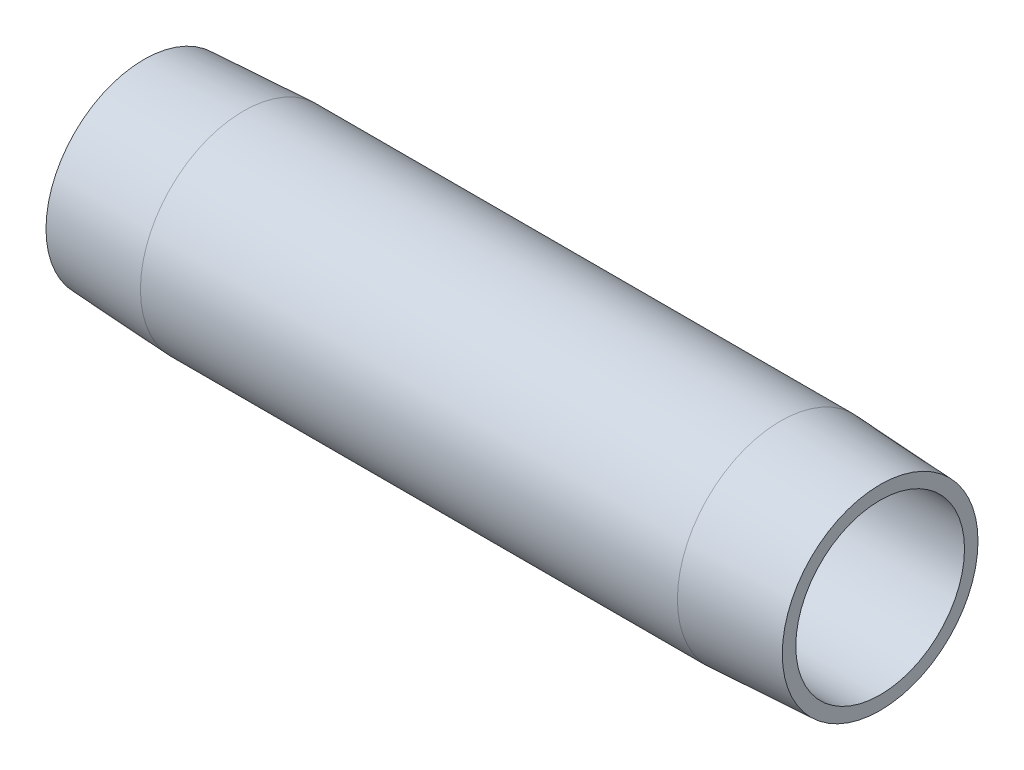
ISO-10303-21;
HEADER;
FILE_DESCRIPTION(('STEP AP214'),'2;1');
FILE_NAME('part.step','',(''),(''),'','','');
FILE_SCHEMA(('AUTOMOTIVE_DESIGN { 1 0 10303 214 1 1 1 1 }'));
ENDSEC;
DATA;
#1=APPLICATION_CONTEXT('core data for automotive mechanical design processes');
#2=APPLICATION_PROTOCOL_DEFINITION('international standard','automotive_design',2000,#1);
#3=PRODUCT_CONTEXT('',#1,'mechanical');
#4=PRODUCT('Part','Part','',(#3));
#5=PRODUCT_RELATED_PRODUCT_CATEGORY('part','',(#4));
#6=PRODUCT_DEFINITION_FORMATION('','',#4);
#7=PRODUCT_DEFINITION_CONTEXT('part definition',#1,'design');
#8=PRODUCT_DEFINITION('design','',#6,#7);
#9=PRODUCT_DEFINITION_SHAPE('','',#8);
#10=(LENGTH_UNIT() NAMED_UNIT(*) SI_UNIT(.MILLI.,.METRE.));
#11=(NAMED_UNIT(*) PLANE_ANGLE_UNIT() SI_UNIT($,.RADIAN.));
#12=(NAMED_UNIT(*) SI_UNIT($,.STERADIAN.) SOLID_ANGLE_UNIT());
#13=UNCERTAINTY_MEASURE_WITH_UNIT(LENGTH_MEASURE(1.E-05),#10,'distance_accuracy_value','');
#14=(GEOMETRIC_REPRESENTATION_CONTEXT(3) GLOBAL_UNCERTAINTY_ASSIGNED_CONTEXT((#13)) GLOBAL_UNIT_ASSIGNED_CONTEXT((#10,
#11,#12)) REPRESENTATION_CONTEXT('',''));
#15=CARTESIAN_POINT('',(0.,0.,0.));
#16=DIRECTION('',(0.,0.,1.));
#17=DIRECTION('',(1.,0.,0.));
#18=AXIS2_PLACEMENT_3D('',#15,#16,#17);
#19=CARTESIAN_POINT('',(76.2,8.73125,0.));
#20=DIRECTION('',(-1.,0.,0.));
#21=DIRECTION('',(0.,0.,1.));
#22=AXIS2_PLACEMENT_3D('',#19,#20,#21);
#23=PLANE('',#22);
#24=CARTESIAN_POINT('',(76.2,0.,0.));
#25=DIRECTION('',(-1.,0.,0.));
#26=DIRECTION('',(0.,0.,1.));
#27=AXIS2_PLACEMENT_3D('',#24,#25,#26);
#28=CIRCLE('',#27,10.1275500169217);
#29=CARTESIAN_POINT('',(76.2,0.,10.1275500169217));
#30=VERTEX_POINT('',#29);
#31=EDGE_CURVE('E10',#30,#30,#28,.T.);
#32=ORIENTED_EDGE('',*,*,#31,.F.);
#33=EDGE_LOOP('',(#32));
#34=FACE_BOUND('',#33,.T.);
#35=CARTESIAN_POINT('',(76.2,0.,0.));
#36=DIRECTION('',(-1.,0.,0.));
#37=DIRECTION('',(0.,0.,1.));
#38=AXIS2_PLACEMENT_3D('',#35,#36,#37);
#39=CIRCLE('',#38,8.73125);
#40=CARTESIAN_POINT('',(76.2,0.,8.73125));
#41=VERTEX_POINT('',#40);
#42=EDGE_CURVE('E52',#41,#41,#39,.T.);
#43=ORIENTED_EDGE('',*,*,#42,.T.);
#44=EDGE_LOOP('',(#43));
#45=FACE_BOUND('',#44,.T.);
#46=ADVANCED_FACE('F30',(#34,#45),#23,.F.);
#47=CARTESIAN_POINT('',(76.2,0.,0.));
#48=DIRECTION('',(-1.,0.,0.));
#49=DIRECTION('',(0.,0.,1.));
#50=AXIS2_PLACEMENT_3D('',#47,#48,#49);
#51=CONICAL_SURFACE('',#50,10.1275500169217,0.052359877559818);
#52=CARTESIAN_POINT('',(65.8876,0.,0.));
#53=DIRECTION('',(-1.,0.,0.));
#54=DIRECTION('',(0.,0.,1.));
#55=AXIS2_PLACEMENT_3D('',#52,#53,#54);
#56=CIRCLE('',#55,10.668);
#57=CARTESIAN_POINT('',(65.8876,0.,10.668));
#58=VERTEX_POINT('',#57);
#59=EDGE_CURVE('E36',#58,#58,#56,.T.);
#60=ORIENTED_EDGE('',*,*,#59,.F.);
#61=EDGE_LOOP('',(#60));
#62=FACE_BOUND('',#61,.T.);
#63=ORIENTED_EDGE('',*,*,#31,.T.);
#64=EDGE_LOOP('',(#63));
#65=FACE_BOUND('',#64,.T.);
#66=ADVANCED_FACE('F77',(#62,#65),#51,.T.);
#67=CARTESIAN_POINT('',(0.,0.,0.));
#68=DIRECTION('',(-1.,0.,0.));
#69=DIRECTION('',(0.,0.,1.));
#70=AXIS2_PLACEMENT_3D('',#67,#68,#69);
#71=CYLINDRICAL_SURFACE('',#70,10.668);
#72=CARTESIAN_POINT('',(10.3124,0.,0.));
#73=DIRECTION('',(-1.,0.,0.));
#74=DIRECTION('',(0.,0.,1.));
#75=AXIS2_PLACEMENT_3D('',#72,#73,#74);
#76=CIRCLE('',#75,10.668);
#77=CARTESIAN_POINT('',(10.3124,0.,10.668));
#78=VERTEX_POINT('',#77);
#79=EDGE_CURVE('E40',#78,#78,#76,.T.);
#80=ORIENTED_EDGE('',*,*,#79,.F.);
#81=EDGE_LOOP('',(#80));
#82=FACE_BOUND('',#81,.T.);
#83=ORIENTED_EDGE('',*,*,#59,.T.);
#84=EDGE_LOOP('',(#83));
#85=FACE_BOUND('',#84,.T.);
#86=ADVANCED_FACE('F72',(#82,#85),#71,.T.);
#87=CARTESIAN_POINT('',(10.3124,0.,0.));
#88=DIRECTION('',(1.,0.,0.));
#89=DIRECTION('',(0.,0.,-1.));
#90=AXIS2_PLACEMENT_3D('',#87,#88,#89);
#91=CONICAL_SURFACE('',#90,10.668,0.0523598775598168);
#92=CARTESIAN_POINT('',(0.,0.,0.));
#93=DIRECTION('',(-1.,0.,0.));
#94=DIRECTION('',(0.,0.,1.));
#95=AXIS2_PLACEMENT_3D('',#92,#93,#94);
#96=CIRCLE('',#95,10.1275500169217);
#97=CARTESIAN_POINT('',(0.,0.,10.1275500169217));
#98=VERTEX_POINT('',#97);
#99=EDGE_CURVE('E44',#98,#98,#96,.T.);
#100=ORIENTED_EDGE('',*,*,#99,.F.);
#101=EDGE_LOOP('',(#100));
#102=FACE_BOUND('',#101,.T.);
#103=ORIENTED_EDGE('',*,*,#79,.T.);
#104=EDGE_LOOP('',(#103));
#105=FACE_BOUND('',#104,.T.);
#106=ADVANCED_FACE('F66',(#102,#105),#91,.T.);
#107=CARTESIAN_POINT('',(0.,10.1275500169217,0.));
#108=DIRECTION('',(1.,0.,0.));
#109=DIRECTION('',(0.,0.,-1.));
#110=AXIS2_PLACEMENT_3D('',#107,#108,#109);
#111=PLANE('',#110);
#112=CARTESIAN_POINT('',(0.,0.,0.));
#113=DIRECTION('',(-1.,0.,0.));
#114=DIRECTION('',(0.,0.,1.));
#115=AXIS2_PLACEMENT_3D('',#112,#113,#114);
#116=CIRCLE('',#115,8.73125);
#117=CARTESIAN_POINT('',(0.,0.,8.73125));
#118=VERTEX_POINT('',#117);
#119=EDGE_CURVE('E49',#118,#118,#116,.T.);
#120=ORIENTED_EDGE('',*,*,#119,.F.);
#121=EDGE_LOOP('',(#120));
#122=FACE_BOUND('',#121,.T.);
#123=ORIENTED_EDGE('',*,*,#99,.T.);
#124=EDGE_LOOP('',(#123));
#125=FACE_BOUND('',#124,.T.);
#126=ADVANCED_FACE('F60',(#122,#125),#111,.F.);
#127=CARTESIAN_POINT('',(0.,0.,0.));
#128=DIRECTION('',(-1.,0.,0.));
#129=DIRECTION('',(0.,0.,1.));
#130=AXIS2_PLACEMENT_3D('',#127,#128,#129);
#131=CYLINDRICAL_SURFACE('',#130,8.73125);
#132=ORIENTED_EDGE('',*,*,#42,.F.);
#133=EDGE_LOOP('',(#132));
#134=FACE_BOUND('',#133,.T.);
#135=ORIENTED_EDGE('',*,*,#119,.T.);
#136=EDGE_LOOP('',(#135));
#137=FACE_BOUND('',#136,.T.);
#138=ADVANCED_FACE('F57',(#134,#137),#131,.F.);
#139=CLOSED_SHELL('',(#46,#66,#86,#106,#126,#138));
#140=MANIFOLD_SOLID_BREP('B2',#139);
#141=ADVANCED_BREP_SHAPE_REPRESENTATION('',(#18,#140),#14);
#142=SHAPE_DEFINITION_REPRESENTATION(#9,#141);
ENDSEC;
END-ISO-10303-21;
